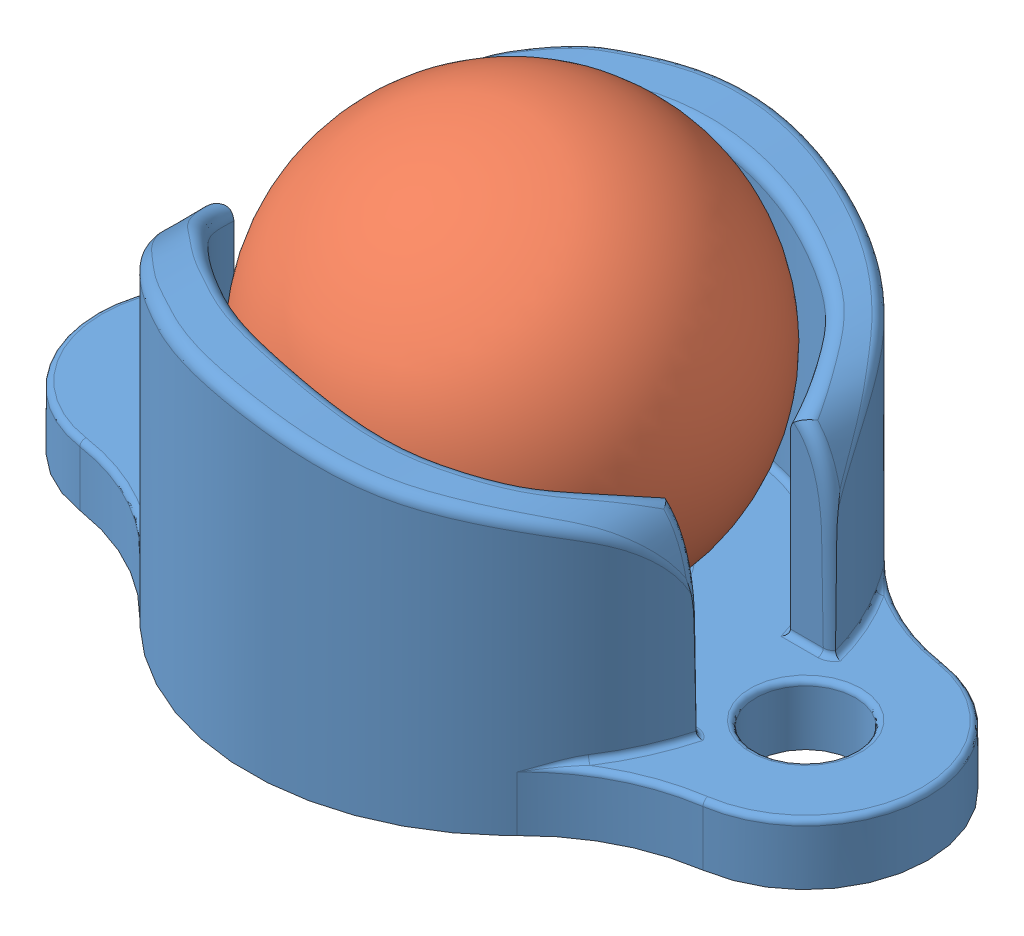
SolidWorks assembly Pololu Ball Caster.SLDASM, configuration Predeterminado (file format 11000). Lengths in mm.
Overall size (19.05 10.36 12.25).
2 component instances, 2 part files, 2 mates.
Components (placement in the parent):
- base-1: base.SLDPRT [Predeterminado] at origin size (19.05 7.74 12.25)
- ball-1: ball.SLDPRT [Predeterminado] at (0 4.8155 0) x (0.999099 0.024067 0.034961) z (-0.035416 0.018735 0.999197) size (9.3 9.3 9.3)
Mates (geometry in assembly coordinates):
- Concéntrica1: concentric: cylinder of base-1 through (0 0.6945 0) axis (0 -1 0) radius 2.856; sphere of ball-1
- Tangente2: tangent: sphere of ball-1; line of assembly
